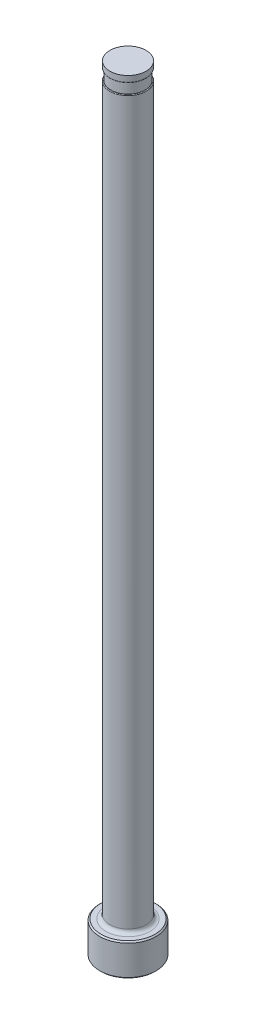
from build123d import *

# Parameters (mm, degrees)
CHAMFER1_SIZE     = 0.254
FILLET1_R         = 0.762
SKETCH2_W         = 0.2032
SKETCH2_H         = 2.032
D_SLOT_DEPTH      = 153.60197502
D_SLOT_DEPTH_BACK = 153.60197502
SKETCH5_W         = 0.01905
SKETCH5_H         = 1.27
FILLET2_R         = 0.127


with BuildPart() as part:
    # Sketch1 → Revolve1 (revolve)
    with BuildSketch(Plane.XY, mode=Mode.PRIVATE) as revolve1_sk:
        Polygon((0, 0), (-5.5499, 0), (-5.5499, 6.35), (-3.57124, 6.35), (-3.57124, 152.4), (0, 152.4), align=None)
    revolve(revolve1_sk.sketch.rotate(Axis((0, 259.958771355, 0), (0, -1, 0)), 270), axis=Axis((0, 259.958771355, 0), (0, -1, 0)))

    # Chamfer1
    chamfer1_edges = [part.edges().sort_by_distance(p)[0] for p in [
        (0, 6.35, -5.5499),
        (0, 0, -5.5499),
    ]]
    chamfer(chamfer1_edges, length=CHAMFER1_SIZE)

    # Fillet1
    fillet1_edges = [part.edges().sort_by_distance(p)[0] for p in [
        (0, 6.35, -3.57124),
    ]]
    fillet(fillet1_edges, radius=FILLET1_R)

    # Sketch2 → Vent Relief (revolve, cut)
    with BuildSketch(Plane.XY, mode=Mode.PRIVATE) as vent_relief_sk:
        with Locations((-3.46964, 150.114)):
            Rectangle(SKETCH2_W, SKETCH2_H)
    revolve(vent_relief_sk.sketch.rotate(Axis((0, 153.448281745, 0), (0, -1, 0)), 270), axis=Axis((0, 153.448281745, 0), (0, -1, 0)), mode=Mode.SUBTRACT)

    # Sketch3 → D-Slot (cut, two sides: drawn at the far end of the back side and taken through both)
    with BuildSketch(Plane.XY.offset(-D_SLOT_DEPTH_BACK)):
        with BuildLine():
            Line((-3.36804, 150.114), (-3.36804, 86.614))
            ThreePointArc((-3.36804, 86.614), (-3.419253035, 86.046038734), (-3.57124, 85.4964))
            Line((-3.57124, 85.4964), (-3.57124, 150.114))
            Line((-3.57124, 150.114), (-3.36804, 150.114))
        make_face()
    extrude(amount=D_SLOT_DEPTH + D_SLOT_DEPTH_BACK, mode=Mode.SUBTRACT)

    # Sketch5 → Vent Diameter (revolve, cut)
    with BuildSketch(Plane.XY, mode=Mode.PRIVATE) as vent_diameter_sk:
        with Locations((-3.561715, 151.765)):
            Rectangle(SKETCH5_W, SKETCH5_H)
    revolve(vent_diameter_sk.sketch.rotate(Axis((0, 152.687735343, 0), (0, -1, 0)), 90), axis=Axis((0, 152.687735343, 0), (0, -1, 0)), mode=Mode.SUBTRACT)

    # Fillet2
    fillet2_edges = [part.edges().sort_by_distance(p)[0] for p in [
        (2.915000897, 149.098, -2.063134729),
        (0, 151.13, 3.55219),
    ]]
    fillet(fillet2_edges, radius=FILLET2_R)


solid = part.part
